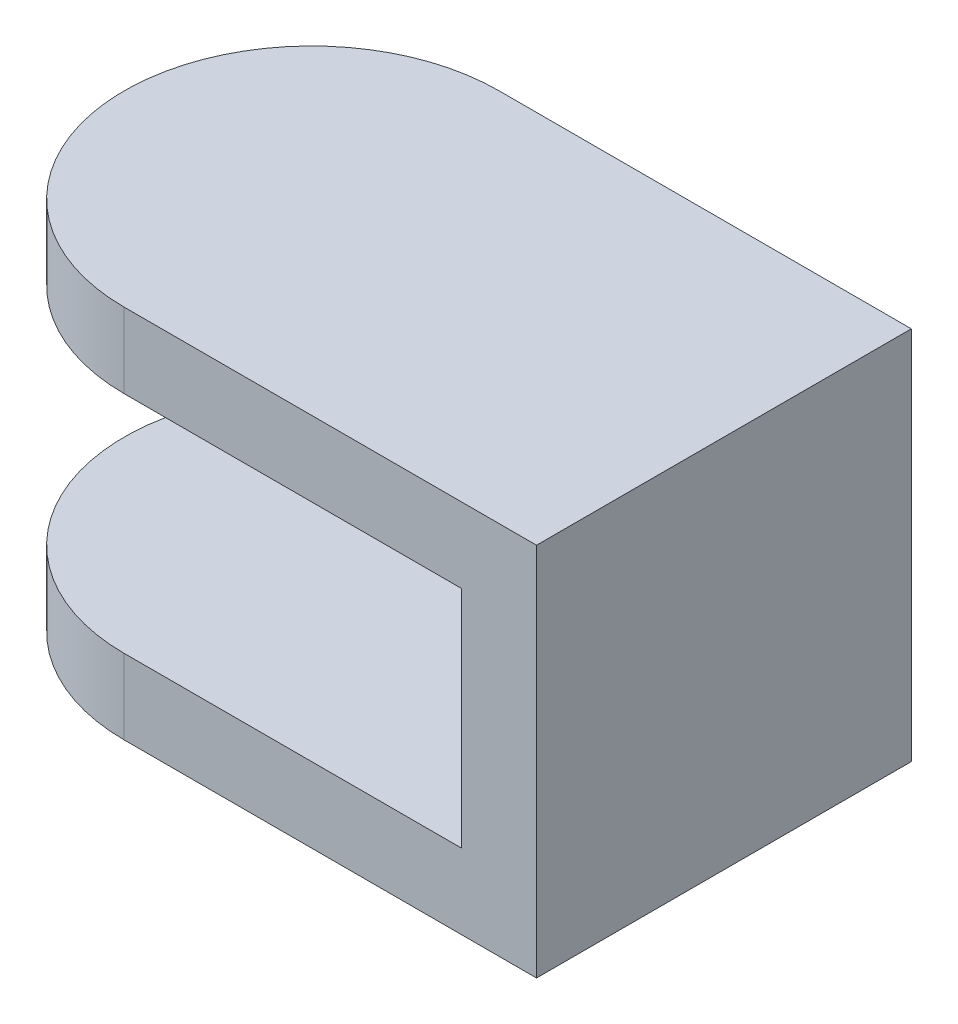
ISO-10303-21;
HEADER;
FILE_DESCRIPTION(('STEP AP214'),'2;1');
FILE_NAME('part.step','',(''),(''),'','','');
FILE_SCHEMA(('AUTOMOTIVE_DESIGN { 1 0 10303 214 1 1 1 1 }'));
ENDSEC;
DATA;
#1=APPLICATION_CONTEXT('core data for automotive mechanical design processes');
#2=APPLICATION_PROTOCOL_DEFINITION('international standard','automotive_design',2000,#1);
#3=PRODUCT_CONTEXT('',#1,'mechanical');
#4=PRODUCT('Part','Part','',(#3));
#5=PRODUCT_RELATED_PRODUCT_CATEGORY('part','',(#4));
#6=PRODUCT_DEFINITION_FORMATION('','',#4);
#7=PRODUCT_DEFINITION_CONTEXT('part definition',#1,'design');
#8=PRODUCT_DEFINITION('design','',#6,#7);
#9=PRODUCT_DEFINITION_SHAPE('','',#8);
#10=(LENGTH_UNIT() NAMED_UNIT(*) SI_UNIT(.MILLI.,.METRE.));
#11=(NAMED_UNIT(*) PLANE_ANGLE_UNIT() SI_UNIT($,.RADIAN.));
#12=(NAMED_UNIT(*) SI_UNIT($,.STERADIAN.) SOLID_ANGLE_UNIT());
#13=UNCERTAINTY_MEASURE_WITH_UNIT(LENGTH_MEASURE(1.E-05),#10,'distance_accuracy_value','');
#14=(GEOMETRIC_REPRESENTATION_CONTEXT(3) GLOBAL_UNCERTAINTY_ASSIGNED_CONTEXT((#13)) GLOBAL_UNIT_ASSIGNED_CONTEXT((#10,
#11,#12)) REPRESENTATION_CONTEXT('',''));
#15=CARTESIAN_POINT('',(0.,0.,0.));
#16=DIRECTION('',(0.,0.,1.));
#17=DIRECTION('',(1.,0.,0.));
#18=AXIS2_PLACEMENT_3D('',#15,#16,#17);
#19=CARTESIAN_POINT('',(-4.99999999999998,-25.,0.));
#20=DIRECTION('',(0.,1.,0.));
#21=DIRECTION('',(-1.,0.,0.));
#22=AXIS2_PLACEMENT_3D('',#19,#20,#21);
#23=CYLINDRICAL_SURFACE('',#22,25.);
#24=DIRECTION('',(0.,-1.,0.));
#25=VECTOR('',#24,1.);
#26=CARTESIAN_POINT('',(-4.99999999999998,-25.,-25.));
#27=LINE('',#26,#25);
#28=CARTESIAN_POINT('',(-4.99999999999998,-25.,-25.));
#29=VERTEX_POINT('',#28);
#30=CARTESIAN_POINT('',(-4.99999999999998,-15.,-25.));
#31=VERTEX_POINT('',#30);
#32=EDGE_CURVE('E158',#29,#31,#27,.F.);
#33=ORIENTED_EDGE('',*,*,#32,.F.);
#34=CARTESIAN_POINT('',(-4.99999999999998,-25.,0.));
#35=DIRECTION('',(0.,-1.,0.));
#36=DIRECTION('',(0.,0.,-1.));
#37=AXIS2_PLACEMENT_3D('',#34,#35,#36);
#38=CIRCLE('',#37,25.);
#39=CARTESIAN_POINT('',(-4.99999999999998,-25.,25.));
#40=VERTEX_POINT('',#39);
#41=EDGE_CURVE('E42',#40,#29,#38,.T.);
#42=ORIENTED_EDGE('',*,*,#41,.F.);
#43=DIRECTION('',(0.,1.,0.));
#44=VECTOR('',#43,1.);
#45=CARTESIAN_POINT('',(-4.99999999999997,0.,25.));
#46=LINE('',#45,#44);
#47=CARTESIAN_POINT('',(-4.99999999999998,-15.,25.));
#48=VERTEX_POINT('',#47);
#49=EDGE_CURVE('E116',#48,#40,#46,.F.);
#50=ORIENTED_EDGE('',*,*,#49,.F.);
#51=CARTESIAN_POINT('',(-4.99999999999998,-15.,0.));
#52=DIRECTION('',(0.,-1.,0.));
#53=DIRECTION('',(0.,0.,-1.));
#54=AXIS2_PLACEMENT_3D('',#51,#52,#53);
#55=CIRCLE('',#54,25.);
#56=EDGE_CURVE('E11',#31,#48,#55,.F.);
#57=ORIENTED_EDGE('',*,*,#56,.F.);
#58=EDGE_LOOP('',(#33,#42,#50,#57));
#59=FACE_BOUND('',#58,.T.);
#60=ADVANCED_FACE('F34',(#59),#23,.T.);
#61=CARTESIAN_POINT('',(-4.99999999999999,25.,0.));
#62=DIRECTION('',(0.,1.,0.));
#63=DIRECTION('',(0.,0.,1.));
#64=AXIS2_PLACEMENT_3D('',#61,#62,#63);
#65=CYLINDRICAL_SURFACE('',#64,25.);
#66=DIRECTION('',(0.,1.,0.));
#67=VECTOR('',#66,1.);
#68=CARTESIAN_POINT('',(-4.99999999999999,0.,25.));
#69=LINE('',#68,#67);
#70=CARTESIAN_POINT('',(-4.99999999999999,25.,25.));
#71=VERTEX_POINT('',#70);
#72=CARTESIAN_POINT('',(-4.99999999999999,15.,25.));
#73=VERTEX_POINT('',#72);
#74=EDGE_CURVE('E107',#71,#73,#69,.F.);
#75=ORIENTED_EDGE('',*,*,#74,.F.);
#76=CARTESIAN_POINT('',(-4.99999999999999,25.,0.));
#77=DIRECTION('',(0.,1.,0.));
#78=DIRECTION('',(0.,0.,1.));
#79=AXIS2_PLACEMENT_3D('',#76,#77,#78);
#80=CIRCLE('',#79,25.);
#81=CARTESIAN_POINT('',(-4.99999999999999,25.,-25.));
#82=VERTEX_POINT('',#81);
#83=EDGE_CURVE('E154',#82,#71,#80,.T.);
#84=ORIENTED_EDGE('',*,*,#83,.F.);
#85=DIRECTION('',(0.,-1.,0.));
#86=VECTOR('',#85,1.);
#87=CARTESIAN_POINT('',(-4.99999999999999,25.,-25.));
#88=LINE('',#87,#86);
#89=CARTESIAN_POINT('',(-4.99999999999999,15.,-25.));
#90=VERTEX_POINT('',#89);
#91=EDGE_CURVE('E151',#90,#82,#88,.F.);
#92=ORIENTED_EDGE('',*,*,#91,.F.);
#93=CARTESIAN_POINT('',(-4.99999999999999,15.,0.));
#94=DIRECTION('',(0.,1.,0.));
#95=DIRECTION('',(0.,0.,1.));
#96=AXIS2_PLACEMENT_3D('',#93,#94,#95);
#97=CIRCLE('',#96,25.);
#98=EDGE_CURVE('E156',#73,#90,#97,.F.);
#99=ORIENTED_EDGE('',*,*,#98,.F.);
#100=EDGE_LOOP('',(#75,#84,#92,#99));
#101=FACE_BOUND('',#100,.T.);
#102=ADVANCED_FACE('F182',(#101),#65,.T.);
#103=CARTESIAN_POINT('',(50.,-15.,25.));
#104=DIRECTION('',(0.,-1.,0.));
#105=DIRECTION('',(0.,0.,-1.));
#106=AXIS2_PLACEMENT_3D('',#103,#104,#105);
#107=PLANE('',#106);
#108=DIRECTION('',(1.,0.,0.));
#109=VECTOR('',#108,1.);
#110=CARTESIAN_POINT('',(50.,-15.,-25.));
#111=LINE('',#110,#109);
#112=CARTESIAN_POINT('',(40.,-15.,-25.));
#113=VERTEX_POINT('',#112);
#114=EDGE_CURVE('E132',#113,#31,#111,.F.);
#115=ORIENTED_EDGE('',*,*,#114,.T.);
#116=ORIENTED_EDGE('',*,*,#56,.T.);
#117=DIRECTION('',(1.,0.,0.));
#118=VECTOR('',#117,1.);
#119=CARTESIAN_POINT('',(50.,-15.,25.));
#120=LINE('',#119,#118);
#121=CARTESIAN_POINT('',(40.,-15.,25.));
#122=VERTEX_POINT('',#121);
#123=EDGE_CURVE('E117',#122,#48,#120,.F.);
#124=ORIENTED_EDGE('',*,*,#123,.F.);
#125=DIRECTION('',(0.,0.,-1.));
#126=VECTOR('',#125,1.);
#127=CARTESIAN_POINT('',(40.,-15.,25.));
#128=LINE('',#127,#126);
#129=EDGE_CURVE('E131',#122,#113,#128,.T.);
#130=ORIENTED_EDGE('',*,*,#129,.T.);
#131=EDGE_LOOP('',(#115,#116,#124,#130));
#132=FACE_BOUND('',#131,.T.);
#133=ADVANCED_FACE('F180',(#132),#107,.F.);
#134=CARTESIAN_POINT('',(50.,-25.,25.));
#135=DIRECTION('',(0.,-1.,0.));
#136=DIRECTION('',(0.,0.,-1.));
#137=AXIS2_PLACEMENT_3D('',#134,#135,#136);
#138=PLANE('',#137);
#139=DIRECTION('',(-1.,0.,0.));
#140=VECTOR('',#139,1.);
#141=CARTESIAN_POINT('',(50.,-25.,25.));
#142=LINE('',#141,#140);
#143=CARTESIAN_POINT('',(50.,-25.,25.));
#144=VERTEX_POINT('',#143);
#145=EDGE_CURVE('E100',#144,#40,#142,.T.);
#146=ORIENTED_EDGE('',*,*,#145,.T.);
#147=ORIENTED_EDGE('',*,*,#41,.T.);
#148=DIRECTION('',(-1.,0.,0.));
#149=VECTOR('',#148,1.);
#150=CARTESIAN_POINT('',(50.,-25.,-25.));
#151=LINE('',#150,#149);
#152=CARTESIAN_POINT('',(50.,-25.,-25.));
#153=VERTEX_POINT('',#152);
#154=EDGE_CURVE('E102',#153,#29,#151,.T.);
#155=ORIENTED_EDGE('',*,*,#154,.F.);
#156=DIRECTION('',(0.,0.,-1.));
#157=VECTOR('',#156,1.);
#158=CARTESIAN_POINT('',(50.,-25.,25.));
#159=LINE('',#158,#157);
#160=EDGE_CURVE('E97',#144,#153,#159,.T.);
#161=ORIENTED_EDGE('',*,*,#160,.F.);
#162=EDGE_LOOP('',(#146,#147,#155,#161));
#163=FACE_BOUND('',#162,.T.);
#164=ADVANCED_FACE('F99',(#163),#138,.T.);
#165=CARTESIAN_POINT('',(50.,25.,25.));
#166=DIRECTION('',(1.,0.,0.));
#167=DIRECTION('',(0.,0.,-1.));
#168=AXIS2_PLACEMENT_3D('',#165,#166,#167);
#169=PLANE('',#168);
#170=DIRECTION('',(0.,-1.,0.));
#171=VECTOR('',#170,1.);
#172=CARTESIAN_POINT('',(50.,25.,-25.));
#173=LINE('',#172,#171);
#174=CARTESIAN_POINT('',(50.,25.,-25.));
#175=VERTEX_POINT('',#174);
#176=EDGE_CURVE('E135',#175,#153,#173,.T.);
#177=ORIENTED_EDGE('',*,*,#176,.F.);
#178=DIRECTION('',(0.,0.,-1.));
#179=VECTOR('',#178,1.);
#180=CARTESIAN_POINT('',(50.,25.,25.));
#181=LINE('',#180,#179);
#182=CARTESIAN_POINT('',(50.,25.,25.));
#183=VERTEX_POINT('',#182);
#184=EDGE_CURVE('E108',#183,#175,#181,.T.);
#185=ORIENTED_EDGE('',*,*,#184,.F.);
#186=DIRECTION('',(0.,-1.,0.));
#187=VECTOR('',#186,1.);
#188=CARTESIAN_POINT('',(50.,25.,25.));
#189=LINE('',#188,#187);
#190=EDGE_CURVE('E115',#183,#144,#189,.T.);
#191=ORIENTED_EDGE('',*,*,#190,.T.);
#192=ORIENTED_EDGE('',*,*,#160,.T.);
#193=EDGE_LOOP('',(#177,#185,#191,#192));
#194=FACE_BOUND('',#193,.T.);
#195=ADVANCED_FACE('F120',(#194),#169,.T.);
#196=CARTESIAN_POINT('',(-30.,25.,25.));
#197=DIRECTION('',(0.,1.,0.));
#198=DIRECTION('',(0.,0.,1.));
#199=AXIS2_PLACEMENT_3D('',#196,#197,#198);
#200=PLANE('',#199);
#201=DIRECTION('',(1.,0.,0.));
#202=VECTOR('',#201,1.);
#203=CARTESIAN_POINT('',(-30.,25.,-25.));
#204=LINE('',#203,#202);
#205=EDGE_CURVE('E137',#82,#175,#204,.T.);
#206=ORIENTED_EDGE('',*,*,#205,.F.);
#207=ORIENTED_EDGE('',*,*,#83,.T.);
#208=DIRECTION('',(1.,0.,0.));
#209=VECTOR('',#208,1.);
#210=CARTESIAN_POINT('',(-30.,25.,25.));
#211=LINE('',#210,#209);
#212=EDGE_CURVE('E122',#71,#183,#211,.T.);
#213=ORIENTED_EDGE('',*,*,#212,.T.);
#214=ORIENTED_EDGE('',*,*,#184,.T.);
#215=EDGE_LOOP('',(#206,#207,#213,#214));
#216=FACE_BOUND('',#215,.T.);
#217=ADVANCED_FACE('F168',(#216),#200,.T.);
#218=CARTESIAN_POINT('',(-30.,15.,25.));
#219=DIRECTION('',(0.,1.,0.));
#220=DIRECTION('',(0.,0.,1.));
#221=AXIS2_PLACEMENT_3D('',#218,#219,#220);
#222=PLANE('',#221);
#223=DIRECTION('',(1.,0.,0.));
#224=VECTOR('',#223,1.);
#225=CARTESIAN_POINT('',(-30.,15.,25.));
#226=LINE('',#225,#224);
#227=CARTESIAN_POINT('',(40.,15.,25.));
#228=VERTEX_POINT('',#227);
#229=EDGE_CURVE('E124',#73,#228,#226,.T.);
#230=ORIENTED_EDGE('',*,*,#229,.F.);
#231=ORIENTED_EDGE('',*,*,#98,.T.);
#232=DIRECTION('',(1.,0.,0.));
#233=VECTOR('',#232,1.);
#234=CARTESIAN_POINT('',(-30.,15.,-25.));
#235=LINE('',#234,#233);
#236=CARTESIAN_POINT('',(40.,15.,-25.));
#237=VERTEX_POINT('',#236);
#238=EDGE_CURVE('E139',#90,#237,#235,.T.);
#239=ORIENTED_EDGE('',*,*,#238,.T.);
#240=DIRECTION('',(0.,0.,-1.));
#241=VECTOR('',#240,1.);
#242=CARTESIAN_POINT('',(40.,15.,25.));
#243=LINE('',#242,#241);
#244=EDGE_CURVE('E145',#228,#237,#243,.T.);
#245=ORIENTED_EDGE('',*,*,#244,.F.);
#246=EDGE_LOOP('',(#230,#231,#239,#245));
#247=FACE_BOUND('',#246,.T.);
#248=ADVANCED_FACE('F174',(#247),#222,.F.);
#249=CARTESIAN_POINT('',(40.,25.,25.));
#250=DIRECTION('',(1.,0.,0.));
#251=DIRECTION('',(0.,0.,-1.));
#252=AXIS2_PLACEMENT_3D('',#249,#250,#251);
#253=PLANE('',#252);
#254=DIRECTION('',(0.,1.,0.));
#255=VECTOR('',#254,1.);
#256=CARTESIAN_POINT('',(40.,25.,-25.));
#257=LINE('',#256,#255);
#258=EDGE_CURVE('E141',#237,#113,#257,.F.);
#259=ORIENTED_EDGE('',*,*,#258,.T.);
#260=ORIENTED_EDGE('',*,*,#129,.F.);
#261=DIRECTION('',(0.,1.,0.));
#262=VECTOR('',#261,1.);
#263=CARTESIAN_POINT('',(40.,25.,25.));
#264=LINE('',#263,#262);
#265=EDGE_CURVE('E129',#228,#122,#264,.F.);
#266=ORIENTED_EDGE('',*,*,#265,.F.);
#267=ORIENTED_EDGE('',*,*,#244,.T.);
#268=EDGE_LOOP('',(#259,#260,#266,#267));
#269=FACE_BOUND('',#268,.T.);
#270=ADVANCED_FACE('F179',(#269),#253,.F.);
#271=CARTESIAN_POINT('',(0.,0.,25.));
#272=DIRECTION('',(0.,0.,1.));
#273=DIRECTION('',(1.,0.,0.));
#274=AXIS2_PLACEMENT_3D('',#271,#272,#273);
#275=PLANE('',#274);
#276=ORIENTED_EDGE('',*,*,#123,.T.);
#277=ORIENTED_EDGE('',*,*,#49,.T.);
#278=ORIENTED_EDGE('',*,*,#145,.F.);
#279=ORIENTED_EDGE('',*,*,#190,.F.);
#280=ORIENTED_EDGE('',*,*,#212,.F.);
#281=ORIENTED_EDGE('',*,*,#74,.T.);
#282=ORIENTED_EDGE('',*,*,#229,.T.);
#283=ORIENTED_EDGE('',*,*,#265,.T.);
#284=EDGE_LOOP('',(#276,#277,#278,#279,#280,#281,#282,#283));
#285=FACE_BOUND('',#284,.T.);
#286=ADVANCED_FACE('F113',(#285),#275,.T.);
#287=CARTESIAN_POINT('',(0.,0.,-25.));
#288=DIRECTION('',(0.,0.,1.));
#289=DIRECTION('',(1.,0.,0.));
#290=AXIS2_PLACEMENT_3D('',#287,#288,#289);
#291=PLANE('',#290);
#292=ORIENTED_EDGE('',*,*,#154,.T.);
#293=ORIENTED_EDGE('',*,*,#32,.T.);
#294=ORIENTED_EDGE('',*,*,#114,.F.);
#295=ORIENTED_EDGE('',*,*,#258,.F.);
#296=ORIENTED_EDGE('',*,*,#238,.F.);
#297=ORIENTED_EDGE('',*,*,#91,.T.);
#298=ORIENTED_EDGE('',*,*,#205,.T.);
#299=ORIENTED_EDGE('',*,*,#176,.T.);
#300=EDGE_LOOP('',(#292,#293,#294,#295,#296,#297,#298,#299));
#301=FACE_BOUND('',#300,.T.);
#302=ADVANCED_FACE('F163',(#301),#291,.F.);
#303=CLOSED_SHELL('',(#60,#102,#133,#164,#195,#217,#248,#270,#286,#302));
#304=MANIFOLD_SOLID_BREP('B2',#303);
#305=ADVANCED_BREP_SHAPE_REPRESENTATION('',(#18,#304),#14);
#306=SHAPE_DEFINITION_REPRESENTATION(#9,#305);
ENDSEC;
END-ISO-10303-21;
